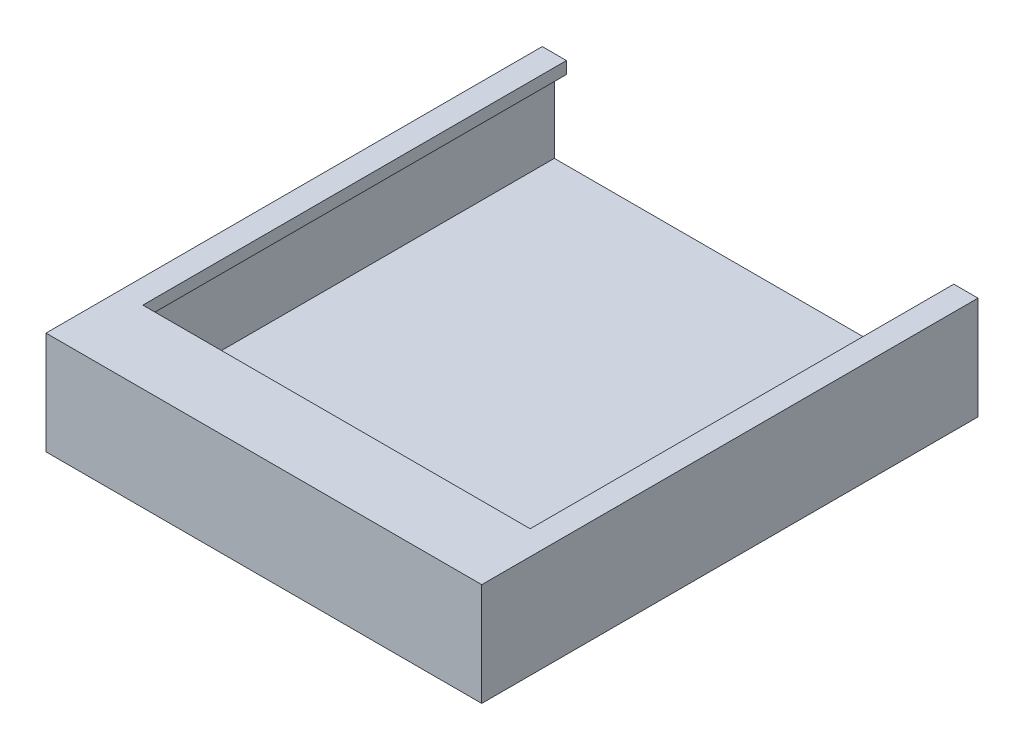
from build123d import *

# Parameters (mm, degrees)
SKETCH1_W           = 68
SKETCH1_H           = 80
BOSS_EXTRUDE1_DEPTH = 2
SKETCH2_W           = 2
SKETCH2_H           = 80
BOSS_EXTRUDE2_DEPTH = 17
SKETCH3_W           = 72
SKETCH3_H           = 2
BOSS_EXTRUDE3_DEPTH = 17
SKETCH4_W           = 68
SKETCH4_H           = 2
BOSS_EXTRUDE4_DEPTH = 10
SKETCH8_W           = 70
SKETCH8_H           = 2
BOSS_EXTRUDE5_DEPTH = 2
SKETCH10_W          = 70
SKETCH10_H          = 2
BOSS_EXTRUDE6_DEPTH = 2


with BuildPart() as part:
    # Sketch1 → Boss-Extrude1 (new body)
    with BuildSketch(Plane(origin=(0, 0, 0), x_dir=(1, 0, 0), z_dir=(0, 1, 0))):
        Rectangle(SKETCH1_W, SKETCH1_H)
    extrude(amount=BOSS_EXTRUDE1_DEPTH)

    # Sketch2 → Boss-Extrude2 (add)
    with BuildSketch(Plane(origin=(0, 0, 0), x_dir=(1, 0, 0), z_dir=(0, 1, 0))):
        with Locations((35, 0)):
            Rectangle(SKETCH2_W, SKETCH2_H)
        with Locations((-35, 0)):
            Rectangle(SKETCH2_W, SKETCH2_H)
    extrude(amount=BOSS_EXTRUDE2_DEPTH)

    # Sketch3 → Boss-Extrude3 (add)
    with BuildSketch(Plane(origin=(0, 0, 0), x_dir=(1, 0, 0), z_dir=(0, 1, 0))):
        with Locations((0, -41)):
            Rectangle(SKETCH3_W, SKETCH3_H)
    extrude(amount=BOSS_EXTRUDE3_DEPTH)

    # Sketch4 → Boss-Extrude4 (add)
    with BuildSketch(Plane(origin=(0, 0, 40), x_dir=(-1, 0, 0), z_dir=(0, 0, -1))):
        with Locations((0, 16)):
            Rectangle(SKETCH4_W, SKETCH4_H)
    extrude(amount=BOSS_EXTRUDE4_DEPTH)

    # Sketch8 → Boss-Extrude5 (add)
    with BuildSketch(Plane.ZY.offset(-34)):
        with Locations((-5, 16)):
            Rectangle(SKETCH8_W, SKETCH8_H)
    extrude(amount=BOSS_EXTRUDE5_DEPTH)

    # Sketch10 → Boss-Extrude6 (add)
    with BuildSketch(Plane(origin=(-34, 0, 0), x_dir=(0, 0, -1), z_dir=(1, 0, 0))):
        with Locations((5, 16)):
            Rectangle(SKETCH10_W, SKETCH10_H)
    extrude(amount=BOSS_EXTRUDE6_DEPTH)


solid = part.part
